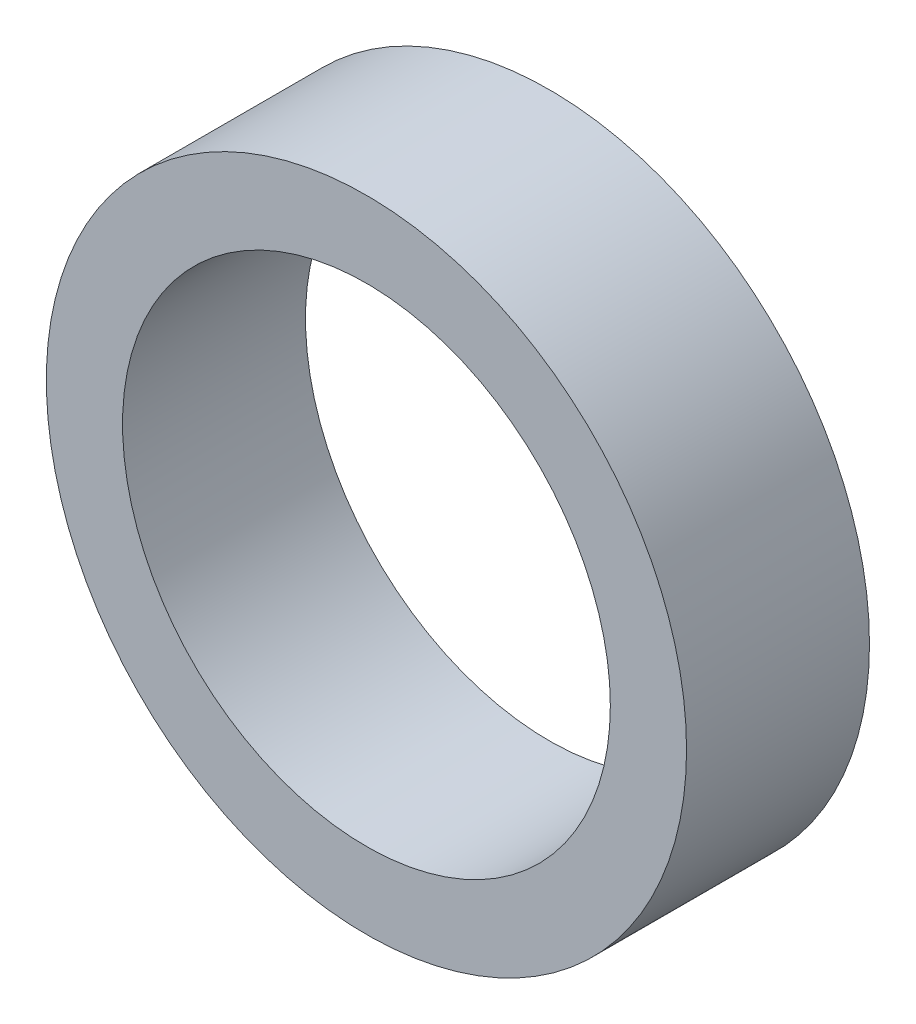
ISO-10303-21;
HEADER;
FILE_DESCRIPTION(('STEP AP214'),'2;1');
FILE_NAME('part.step','',(''),(''),'','','');
FILE_SCHEMA(('AUTOMOTIVE_DESIGN { 1 0 10303 214 1 1 1 1 }'));
ENDSEC;
DATA;
#1=APPLICATION_CONTEXT('core data for automotive mechanical design processes');
#2=APPLICATION_PROTOCOL_DEFINITION('international standard','automotive_design',2000,#1);
#3=PRODUCT_CONTEXT('',#1,'mechanical');
#4=PRODUCT('Part','Part','',(#3));
#5=PRODUCT_RELATED_PRODUCT_CATEGORY('part','',(#4));
#6=PRODUCT_DEFINITION_FORMATION('','',#4);
#7=PRODUCT_DEFINITION_CONTEXT('part definition',#1,'design');
#8=PRODUCT_DEFINITION('design','',#6,#7);
#9=PRODUCT_DEFINITION_SHAPE('','',#8);
#10=(LENGTH_UNIT() NAMED_UNIT(*) SI_UNIT(.MILLI.,.METRE.));
#11=(NAMED_UNIT(*) PLANE_ANGLE_UNIT() SI_UNIT($,.RADIAN.));
#12=(NAMED_UNIT(*) SI_UNIT($,.STERADIAN.) SOLID_ANGLE_UNIT());
#13=UNCERTAINTY_MEASURE_WITH_UNIT(LENGTH_MEASURE(1.E-05),#10,'distance_accuracy_value','');
#14=(GEOMETRIC_REPRESENTATION_CONTEXT(3) GLOBAL_UNCERTAINTY_ASSIGNED_CONTEXT((#13)) GLOBAL_UNIT_ASSIGNED_CONTEXT((#10,
#11,#12)) REPRESENTATION_CONTEXT('',''));
#15=CARTESIAN_POINT('',(0.,0.,0.));
#16=DIRECTION('',(0.,0.,1.));
#17=DIRECTION('',(1.,0.,0.));
#18=AXIS2_PLACEMENT_3D('',#15,#16,#17);
#19=CARTESIAN_POINT('',(0.,0.,6.));
#20=DIRECTION('',(0.,0.,-1.));
#21=DIRECTION('',(0.,1.,0.));
#22=AXIS2_PLACEMENT_3D('',#19,#20,#21);
#23=CYLINDRICAL_SURFACE('',#22,8.);
#24=CARTESIAN_POINT('',(0.,0.,6.));
#25=DIRECTION('',(0.,0.,-1.));
#26=DIRECTION('',(1.,0.,0.));
#27=AXIS2_PLACEMENT_3D('',#24,#25,#26);
#28=CIRCLE('',#27,8.);
#29=CARTESIAN_POINT('',(8.,0.,6.));
#30=VERTEX_POINT('',#29);
#31=EDGE_CURVE('E8',#30,#30,#28,.T.);
#32=ORIENTED_EDGE('',*,*,#31,.F.);
#33=EDGE_LOOP('',(#32));
#34=FACE_BOUND('',#33,.T.);
#35=CARTESIAN_POINT('',(0.,0.,0.));
#36=DIRECTION('',(0.,0.,-1.));
#37=DIRECTION('',(1.,0.,0.));
#38=AXIS2_PLACEMENT_3D('',#35,#36,#37);
#39=CIRCLE('',#38,8.);
#40=CARTESIAN_POINT('',(8.,0.,0.));
#41=VERTEX_POINT('',#40);
#42=EDGE_CURVE('E23',#41,#41,#39,.T.);
#43=ORIENTED_EDGE('',*,*,#42,.T.);
#44=EDGE_LOOP('',(#43));
#45=FACE_BOUND('',#44,.T.);
#46=ADVANCED_FACE('F12',(#34,#45),#23,.F.);
#47=CARTESIAN_POINT('',(0.,0.,6.));
#48=DIRECTION('',(0.,0.,-1.));
#49=DIRECTION('',(0.,1.,0.));
#50=AXIS2_PLACEMENT_3D('',#47,#48,#49);
#51=CYLINDRICAL_SURFACE('',#50,10.5);
#52=CARTESIAN_POINT('',(0.,0.,6.));
#53=DIRECTION('',(0.,0.,-1.));
#54=DIRECTION('',(1.,0.,0.));
#55=AXIS2_PLACEMENT_3D('',#52,#53,#54);
#56=CIRCLE('',#55,10.5);
#57=CARTESIAN_POINT('',(10.5,0.,6.));
#58=VERTEX_POINT('',#57);
#59=EDGE_CURVE('E19',#58,#58,#56,.T.);
#60=ORIENTED_EDGE('',*,*,#59,.T.);
#61=EDGE_LOOP('',(#60));
#62=FACE_BOUND('',#61,.T.);
#63=CARTESIAN_POINT('',(0.,0.,0.));
#64=DIRECTION('',(0.,0.,-1.));
#65=DIRECTION('',(1.,0.,0.));
#66=AXIS2_PLACEMENT_3D('',#63,#64,#65);
#67=CIRCLE('',#66,10.5);
#68=CARTESIAN_POINT('',(10.5,0.,0.));
#69=VERTEX_POINT('',#68);
#70=EDGE_CURVE('E28',#69,#69,#67,.T.);
#71=ORIENTED_EDGE('',*,*,#70,.F.);
#72=EDGE_LOOP('',(#71));
#73=FACE_BOUND('',#72,.T.);
#74=ADVANCED_FACE('F14',(#62,#73),#51,.T.);
#75=CARTESIAN_POINT('',(0.,0.,6.));
#76=DIRECTION('',(0.,0.,-1.));
#77=DIRECTION('',(0.,1.,0.));
#78=AXIS2_PLACEMENT_3D('',#75,#76,#77);
#79=PLANE('',#78);
#80=ORIENTED_EDGE('',*,*,#31,.T.);
#81=EDGE_LOOP('',(#80));
#82=FACE_BOUND('',#81,.T.);
#83=ORIENTED_EDGE('',*,*,#59,.F.);
#84=EDGE_LOOP('',(#83));
#85=FACE_BOUND('',#84,.T.);
#86=ADVANCED_FACE('F40',(#82,#85),#79,.F.);
#87=CARTESIAN_POINT('',(0.,0.,0.));
#88=DIRECTION('',(0.,0.,-1.));
#89=DIRECTION('',(0.,1.,0.));
#90=AXIS2_PLACEMENT_3D('',#87,#88,#89);
#91=PLANE('',#90);
#92=ORIENTED_EDGE('',*,*,#42,.F.);
#93=EDGE_LOOP('',(#92));
#94=FACE_BOUND('',#93,.T.);
#95=ORIENTED_EDGE('',*,*,#70,.T.);
#96=EDGE_LOOP('',(#95));
#97=FACE_BOUND('',#96,.T.);
#98=ADVANCED_FACE('F37',(#94,#97),#91,.T.);
#99=CLOSED_SHELL('',(#46,#74,#86,#98));
#100=MANIFOLD_SOLID_BREP('B1',#99);
#101=ADVANCED_BREP_SHAPE_REPRESENTATION('',(#18,#100),#14);
#102=SHAPE_DEFINITION_REPRESENTATION(#9,#101);
ENDSEC;
END-ISO-10303-21;
